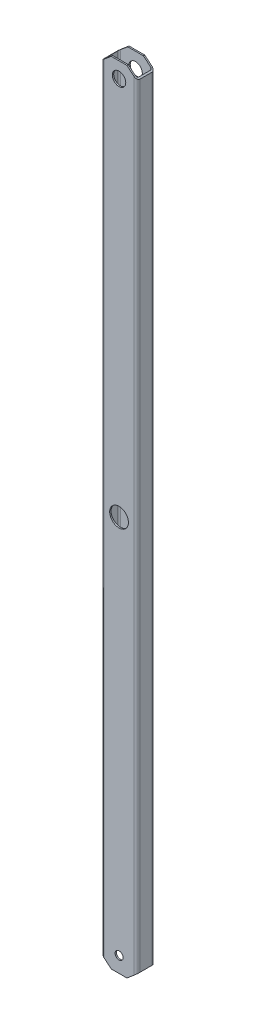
from build123d import *

# Parameters (mm, degrees)
TUBO_RETTANGOLARE_80_X_40_X_3_0_2_DEPTH = 1770
TAGLIO_ESTRUSIONE1_REACH                = 888.806
SCHIZZO8_R                              = 15
SCHIZZO8_R_2                            = 21
SCHIZZO8_R_3                            = 9


with BuildPart() as part:
    # Sketch15 → Tubo rettangolare 80 X 40 X 3.0_2 (new body)
    with BuildSketch(Plane(origin=(0, 885, 0), x_dir=(0, 0, -1), z_dir=(0, -1, 0))):
        with BuildLine():
            Line((-13.6, -40), (13.6, -40))
            ThreePointArc((13.6, -40), (18.1254834, -38.1254834), (20, -33.6))
            Line((20, -33.6), (20, 33.6))
            ThreePointArc((20, 33.6), (18.1254834, 38.1254834), (13.6, 40))
            Line((13.6, 40), (-13.6, 40))
            ThreePointArc((-13.6, 40), (-18.1254834, 38.1254834), (-20, 33.6))
            Line((-20, 33.6), (-20, -33.6))
            ThreePointArc((-20, -33.6), (-18.1254834, -38.1254834), (-13.6, -40))
        make_face()
        with BuildLine():
            Line((-13.6, -37), (13.6, -37))
            ThreePointArc((13.6, -37), (16.004163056, -36.004163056), (17, -33.6))
            Line((17, -33.6), (17, 33.6))
            ThreePointArc((17, 33.6), (16.004163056, 36.004163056), (13.6, 37))
            Line((13.6, 37), (-13.6, 37))
            ThreePointArc((-13.6, 37), (-16.004163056, 36.004163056), (-17, 33.6))
            Line((-17, 33.6), (-17, -33.6))
            ThreePointArc((-17, -33.6), (-16.004163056, -36.004163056), (-13.6, -37))
        make_face(mode=Mode.SUBTRACT)
    extrude(amount=TUBO_RETTANGOLARE_80_X_40_X_3_0_2_DEPTH)

    # Taglio-Estrusione1: up to this face of the body (flat: up to its plane)
    taglio_estrusione1_end = Plane(part.part.faces().sort_by_distance((0, 0, -20))[0])
    # Schizzo8 → Taglio-Estrusione1 (cut, up to the picked face)
    with BuildSketch(Plane.XY.offset(20), mode=Mode.PRIVATE) as taglio_estrusione1_sk1:
        with Locations(Location((0, 850, 0), (0, 0, 270))):
            Circle(SCHIZZO8_R)
    taglio_estrusione1_tool1 = split(extrude(taglio_estrusione1_sk1.sketch, amount=-TAGLIO_ESTRUSIONE1_REACH, mode=Mode.PRIVATE), bisect_by=taglio_estrusione1_end, keep=Keep.BOTH, mode=Mode.PRIVATE)
    # Schizzo8 → Taglio-Estrusione1 (cut, up to the picked face)
    with BuildSketch(Plane.XY.offset(20), mode=Mode.PRIVATE) as taglio_estrusione1_sk2:
        with Locations(Location((0, 0, 0), (0, 0, 270))):
            Circle(SCHIZZO8_R_2)
    taglio_estrusione1_tool2 = split(extrude(taglio_estrusione1_sk2.sketch, amount=-TAGLIO_ESTRUSIONE1_REACH, mode=Mode.PRIVATE), bisect_by=taglio_estrusione1_end, keep=Keep.BOTH, mode=Mode.PRIVATE)
    # Schizzo8 → Taglio-Estrusione1 (cut, up to the picked face)
    with BuildSketch(Plane.XY.offset(20), mode=Mode.PRIVATE) as taglio_estrusione1_sk3:
        with Locations(Location((0, -850, 0), (0, 0, 270))):
            Circle(SCHIZZO8_R_3)
    taglio_estrusione1_tool3 = split(extrude(taglio_estrusione1_sk3.sketch, amount=-TAGLIO_ESTRUSIONE1_REACH, mode=Mode.PRIVATE), bisect_by=taglio_estrusione1_end, keep=Keep.BOTH, mode=Mode.PRIVATE)
    # Schizzo8 → Taglio-Estrusione1 (cut, up to the picked face)
    with BuildSketch(Plane.XY.offset(20), mode=Mode.PRIVATE) as taglio_estrusione1_sk4:
        Polygon((-40, 866.120258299), (-17.5, 885), (-40, 885), align=None)
    taglio_estrusione1_tool4 = split(extrude(taglio_estrusione1_sk4.sketch, amount=-TAGLIO_ESTRUSIONE1_REACH, mode=Mode.PRIVATE), bisect_by=taglio_estrusione1_end, keep=Keep.BOTH, mode=Mode.PRIVATE)
    # Schizzo8 → Taglio-Estrusione1 (cut, up to the picked face)
    with BuildSketch(Plane.XY.offset(20), mode=Mode.PRIVATE) as taglio_estrusione1_sk5:
        Polygon((17.5, 885), (40, 885), (40, 866.120258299), align=None)
    taglio_estrusione1_tool5 = split(extrude(taglio_estrusione1_sk5.sketch, amount=-TAGLIO_ESTRUSIONE1_REACH, mode=Mode.PRIVATE), bisect_by=taglio_estrusione1_end, keep=Keep.BOTH, mode=Mode.PRIVATE)
    # Schizzo8 → Taglio-Estrusione1 (cut, up to the picked face)
    with BuildSketch(Plane.XY.offset(20), mode=Mode.PRIVATE) as taglio_estrusione1_sk6:
        Polygon((40, -866.120258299), (17.5, -885), (40, -885), align=None)
    taglio_estrusione1_tool6 = split(extrude(taglio_estrusione1_sk6.sketch, amount=-TAGLIO_ESTRUSIONE1_REACH, mode=Mode.PRIVATE), bisect_by=taglio_estrusione1_end, keep=Keep.BOTH, mode=Mode.PRIVATE)
    # Schizzo8 → Taglio-Estrusione1 (cut, up to the picked face)
    with BuildSketch(Plane.XY.offset(20), mode=Mode.PRIVATE) as taglio_estrusione1_sk7:
        Polygon((-17.5, -885), (-40, -885), (-40, -866.120258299), align=None)
    taglio_estrusione1_tool7 = split(extrude(taglio_estrusione1_sk7.sketch, amount=-TAGLIO_ESTRUSIONE1_REACH, mode=Mode.PRIVATE), bisect_by=taglio_estrusione1_end, keep=Keep.BOTH, mode=Mode.PRIVATE)
    add(taglio_estrusione1_tool1.solids().sort_by(Axis((0, 850, 20), (0, 0, -1)))[0], mode=Mode.SUBTRACT)
    add(taglio_estrusione1_tool2.solids().sort_by(Axis((0, 0, 20), (0, 0, -1)))[0], mode=Mode.SUBTRACT)
    add(taglio_estrusione1_tool3.solids().sort_by(Axis((0, -850, 20), (0, 0, -1)))[0], mode=Mode.SUBTRACT)
    add(taglio_estrusione1_tool4.solids().sort_by(Axis((-32.5, 878.706753, 20), (0, 0, -1)))[0], mode=Mode.SUBTRACT)
    add(taglio_estrusione1_tool5.solids().sort_by(Axis((32.5, 878.706753, 20), (0, 0, -1)))[0], mode=Mode.SUBTRACT)
    add(taglio_estrusione1_tool6.solids().sort_by(Axis((32.5, -878.706753, 20), (0, 0, -1)))[0], mode=Mode.SUBTRACT)
    add(taglio_estrusione1_tool7.solids().sort_by(Axis((-32.5, -878.706753, 20), (0, 0, -1)))[0], mode=Mode.SUBTRACT)


solid = part.part
